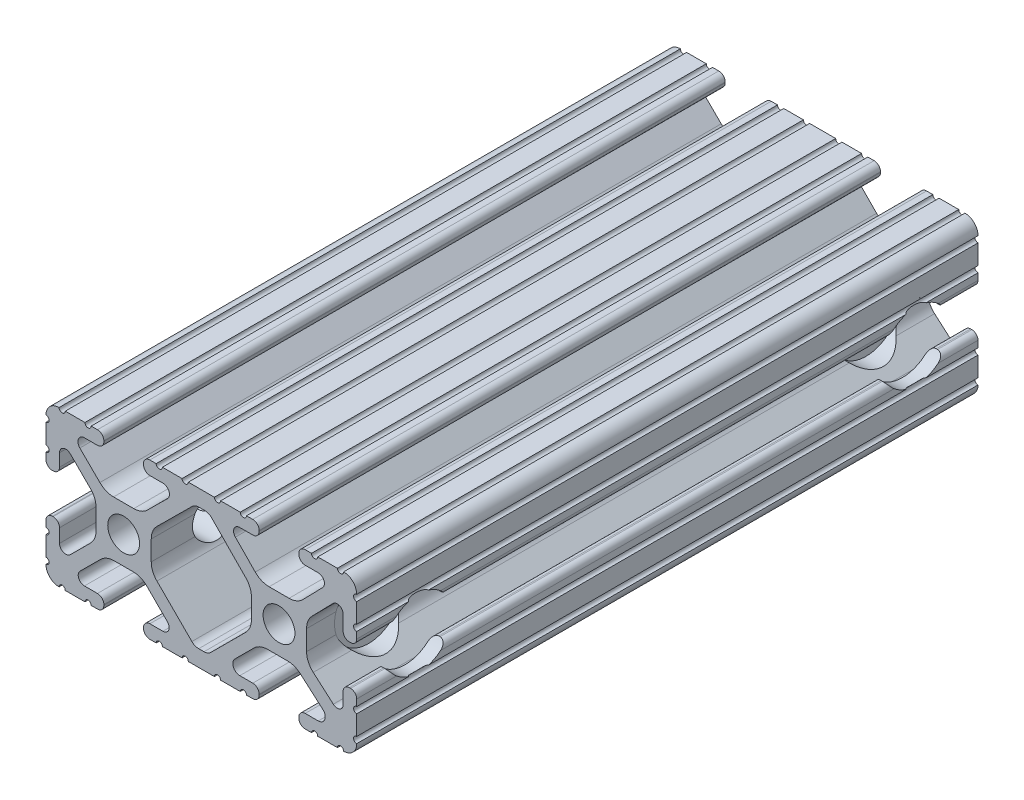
from build123d import *

# Parameters (mm, degrees)
SKETCH1_R                                        = 2.6035
BOSS_EXTRUDE1_DEPTH                              = 50.8
CBORE_FOR_1_4_SOCKET_HEAD_CAP_SCREW2_D           = 6.7564
CBORE_FOR_1_4_SOCKET_HEAD_CAP_SCREW2_CBORE_D     = 11.1125
CBORE_FOR_1_4_SOCKET_HEAD_CAP_SCREW2_CBORE_DEPTH = 8.191799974


with BuildPart() as part:
    # Sketch1 → Boss-Extrude1 (new, symmetric)
    with BuildSketch(Plane.XY):
        with BuildLine():
            Line((18.01710265, 12.7), (16.98745015, 12.7))
            ThreePointArc((16.98745015, 12.7), (16.245730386, 12.392769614), (15.9385, 11.65104985))
            Line((15.9385, 11.65104985), (15.9385, 11.53922))
            ThreePointArc((15.9385, 11.53922), (16.245750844, 10.797450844), (16.98752, 10.4902))
            Line((16.98752, 10.4902), (19.116384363, 10.4902))
            ThreePointArc((19.116384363, 10.4902), (20.052502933, 9.869096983), (19.844087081, 8.765172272))
            Line((19.844087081, 8.765172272), (16.618993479, 5.455112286))
            ThreePointArc((16.618993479, 5.455112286), (15.578994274, 4.745442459), (14.344932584, 4.4958))
            Line((14.344932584, 4.4958), (11.083317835, 4.4958))
            ThreePointArc((11.083317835, 4.4958), (9.854330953, 4.743306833), (8.816955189, 5.447238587))
            Line((8.816955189, 5.447238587), (5.564154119, 8.762652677))
            ThreePointArc((5.564154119, 8.762652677), (5.352591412, 9.867473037), (6.289393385, 10.4902))
            Line((6.289393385, 10.4902), (8.41248, 10.4902))
            ThreePointArc((8.41248, 10.4902), (9.154249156, 10.797450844), (9.4615, 11.53922))
            Line((9.4615, 11.53922), (9.4615, 11.65104985))
            ThreePointArc((9.4615, 11.65104985), (9.154269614, 12.392769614), (8.41254985, 12.7))
            Line((8.41254985, 12.7), (7.38288465, 12.7))
            ThreePointArc((7.38288465, 12.7), (6.87488465, 12.192), (6.36688465, 12.7))
            Line((6.36688465, 12.7), (3.14958095, 12.7))
            ThreePointArc((3.14958095, 12.7), (2.64158095, 12.192), (2.13358095, 12.7))
            Line((2.13358095, 12.7), (-2.13358095, 12.7))
            ThreePointArc((-2.13358095, 12.7), (-2.64158095, 12.192), (-3.14958095, 12.7))
            Line((-3.14958095, 12.7), (-6.36689735, 12.7))
            ThreePointArc((-6.36689735, 12.7), (-6.87489735, 12.192), (-7.38289735, 12.7))
            Line((-7.38289735, 12.7), (-8.41254985, 12.7))
            ThreePointArc((-8.41254985, 12.7), (-9.154269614, 12.392769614), (-9.4615, 11.65104985))
            Line((-9.4615, 11.65104985), (-9.4615, 11.53922))
            ThreePointArc((-9.4615, 11.53922), (-9.154249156, 10.797450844), (-8.41248, 10.4902))
            Line((-8.41248, 10.4902), (-6.283641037, 10.4902))
            ThreePointArc((-6.283641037, 10.4902), (-5.297291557, 9.829633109), (-5.532576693, 8.666071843))
            Line((-5.532576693, 8.666071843), (-8.809985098, 5.416263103))
            ThreePointArc((-8.809985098, 5.416263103), (-9.836720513, 4.734920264), (-11.045536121, 4.4958))
            Line((-11.045536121, 4.4958), (-14.354463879, 4.4958))
            ThreePointArc((-14.354463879, 4.4958), (-15.563279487, 4.734920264), (-16.590014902, 5.416263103))
            Line((-16.590014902, 5.416263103), (-19.867423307, 8.666071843))
            ThreePointArc((-19.867423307, 8.666071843), (-20.102708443, 9.829633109), (-19.116358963, 10.4902))
            Line((-19.116358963, 10.4902), (-16.98752, 10.4902))
            ThreePointArc((-16.98752, 10.4902), (-16.245750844, 10.797450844), (-15.9385, 11.53922))
            Line((-15.9385, 11.53922), (-15.9385, 11.65104985))
            ThreePointArc((-15.9385, 11.65104985), (-16.245730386, 12.392769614), (-16.98745015, 12.7))
            Line((-16.98745015, 12.7), (-18.01711535, 12.7))
            ThreePointArc((-18.01711535, 12.7), (-18.52511535, 12.192), (-19.03311535, 12.7))
            Line((-19.03311535, 12.7), (-22.2504, 12.7))
            ThreePointArc((-22.2504, 12.7), (-22.758323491, 12.192000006), (-23.266399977, 12.699846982))
            ThreePointArc((-23.266399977, 12.699846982), (-24.782522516, 12.082522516), (-25.399846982, 10.566399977))
            ThreePointArc((-25.399846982, 10.566399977), (-24.892000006, 10.058323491), (-25.4, 9.5504))
            Line((-25.4, 9.5504), (-25.4, 6.3330836))
            ThreePointArc((-25.4, 6.3330836), (-24.892, 5.8250836), (-25.4, 5.3170836))
            Line((-25.4, 5.3170836), (-25.4, 4.237520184))
            ThreePointArc((-25.4, 4.237520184), (-25.107393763, 3.531106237), (-24.400979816, 3.2385))
            Line((-24.400979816, 3.2385), (-24.23922, 3.2385))
            ThreePointArc((-24.23922, 3.2385), (-23.497450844, 3.545750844), (-23.1902, 4.28752))
            Line((-23.1902, 4.28752), (-23.1902, 6.334741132))
            ThreePointArc((-23.1902, 6.334741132), (-22.556026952, 7.286023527), (-21.434002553, 7.066535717))
            Line((-21.434002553, 7.066535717), (-18.147950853, 3.808156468))
            ThreePointArc((-18.147950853, 3.808156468), (-17.452759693, 2.774838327), (-17.208501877, 1.553619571))
            Line((-17.208501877, 1.553619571), (-17.208501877, -1.695179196))
            ThreePointArc((-17.208501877, -1.695179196), (-17.450738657, -2.911536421), (-18.140486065, -3.942289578))
            Line((-18.140486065, -3.942289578), (-21.431579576, -7.227386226))
            ThreePointArc((-21.431579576, -7.227386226), (-22.55444896, -7.449940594), (-23.1902, -6.498002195))
            Line((-23.1902, -6.498002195), (-23.1902, -4.28752))
            ThreePointArc((-23.1902, -4.28752), (-23.497450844, -3.545750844), (-24.23922, -3.2385))
            Line((-24.23922, -3.2385), (-24.35098, -3.2385))
            ThreePointArc((-24.35098, -3.2385), (-25.092749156, -3.545750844), (-25.4, -4.28752))
            Line((-25.4, -4.28752), (-25.4, -5.3171344))
            ThreePointArc((-25.4, -5.3171344), (-24.892, -5.8251344), (-25.4, -6.3331344))
            Line((-25.4, -6.3331344), (-25.4, -9.5504))
            ThreePointArc((-25.4, -9.5504), (-24.892000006, -10.058323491), (-25.399846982, -10.566399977))
            ThreePointArc((-25.399846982, -10.566399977), (-24.782522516, -12.082522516), (-23.266399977, -12.699846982))
            ThreePointArc((-23.266399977, -12.699846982), (-22.758323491, -12.192000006), (-22.2504, -12.7))
            Line((-22.2504, -12.7), (-19.03308995, -12.7))
            ThreePointArc((-19.03308995, -12.7), (-18.52508995, -12.192), (-18.01708995, -12.7))
            Line((-18.01708995, -12.7), (-16.9874692, -12.7))
            ThreePointArc((-16.9874692, -12.7), (-16.245700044, -12.392749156), (-15.9384492, -11.65098))
            Line((-15.9384492, -11.65098), (-15.9384492, -11.53922))
            ThreePointArc((-15.9384492, -11.53922), (-16.245700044, -10.797450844), (-16.9874692, -10.4902))
            Line((-16.9874692, -10.4902), (-19.116358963, -10.4902))
            ThreePointArc((-19.116358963, -10.4902), (-20.055197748, -9.862578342), (-19.834124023, -8.755124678))
            Line((-19.834124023, -8.755124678), (-16.49660751, -5.423689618))
            ThreePointArc((-16.49660751, -5.423689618), (-15.467274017, -4.736928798), (-14.253591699, -4.4958))
            Line((-14.253591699, -4.4958), (-11.146408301, -4.4958))
            ThreePointArc((-11.146408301, -4.4958), (-9.932725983, -4.736928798), (-8.90339249, -5.423689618))
            Line((-8.90339249, -5.423689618), (-5.565875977, -8.755124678))
            ThreePointArc((-5.565875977, -8.755124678), (-5.344802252, -9.862578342), (-6.283641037, -10.4902))
            Line((-6.283641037, -10.4902), (-8.4125308, -10.4902))
            ThreePointArc((-8.4125308, -10.4902), (-9.154299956, -10.797450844), (-9.4615508, -11.53922))
            Line((-9.4615508, -11.53922), (-9.4615508, -11.65098))
            ThreePointArc((-9.4615508, -11.65098), (-9.154299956, -12.392749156), (-8.4125308, -12.7))
            Line((-8.4125308, -12.7), (-7.38287195, -12.7))
            ThreePointArc((-7.38287195, -12.7), (-6.87487195, -12.192), (-6.36687195, -12.7))
            Line((-6.36687195, -12.7), (-3.14960635, -12.7))
            ThreePointArc((-3.14960635, -12.7), (-2.64160635, -12.192), (-2.13360635, -12.7))
            Line((-2.13360635, -12.7), (2.13360635, -12.7))
            ThreePointArc((2.13360635, -12.7), (2.64159365, -12.1920127), (3.14958095, -12.7))
            Line((3.14958095, -12.7), (6.36691005, -12.7))
            ThreePointArc((6.36691005, -12.7), (6.87491005, -12.192), (7.38291005, -12.7))
            Line((7.38291005, -12.7), (8.4125308, -12.7))
            ThreePointArc((8.4125308, -12.7), (9.154299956, -12.392749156), (9.4615508, -11.65098))
            Line((9.4615508, -11.65098), (9.4615508, -11.53922))
            ThreePointArc((9.4615508, -11.53922), (9.154299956, -10.797450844), (8.4125308, -10.4902))
            Line((8.4125308, -10.4902), (6.289393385, -10.4902))
            ThreePointArc((6.289393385, -10.4902), (5.231590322, -9.783049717), (5.480677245, -8.535265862))
            Line((5.480677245, -8.535265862), (8.597933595, -5.423689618))
            ThreePointArc((8.597933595, -5.423689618), (9.627267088, -4.736928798), (10.840949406, -4.4958))
            Line((10.840949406, -4.4958), (14.102564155, -4.4958))
            ThreePointArc((14.102564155, -4.4958), (15.215927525, -4.697410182), (16.187895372, -5.276636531))
            Line((16.187895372, -5.276636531), (19.868247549, -8.482246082))
            ThreePointArc((19.868247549, -8.482246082), (20.188435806, -9.746879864), (19.116384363, -10.4902))
            Line((19.116384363, -10.4902), (16.9874692, -10.4902))
            ThreePointArc((16.9874692, -10.4902), (16.245700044, -10.797450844), (15.9384492, -11.53922))
            Line((15.9384492, -11.53922), (15.9384492, -11.65098))
            ThreePointArc((15.9384492, -11.65098), (16.245700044, -12.392749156), (16.9874692, -12.7))
            Line((16.9874692, -12.7), (18.01710265, -12.7))
            ThreePointArc((18.01710265, -12.7), (18.52510265, -12.192), (19.03310265, -12.7))
            Line((19.03310265, -12.7), (22.2504, -12.7))
            ThreePointArc((22.2504, -12.7), (22.758323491, -12.192000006), (23.266399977, -12.699846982))
            ThreePointArc((23.266399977, -12.699846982), (24.782522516, -12.082522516), (25.399846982, -10.566399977))
            ThreePointArc((25.399846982, -10.566399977), (24.892000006, -10.058323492), (25.4, -9.550400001))
            Line((25.4, -9.550400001), (25.4, -6.333083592))
            ThreePointArc((25.4, -6.333083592), (24.892000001, -5.825083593), (25.4, -5.317083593))
            Line((25.4, -5.317083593), (25.4, -4.237520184))
            ThreePointArc((25.4, -4.237520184), (25.107393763, -3.531106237), (24.400979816, -3.2385))
            Line((24.400979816, -3.2385), (24.189220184, -3.2385))
            ThreePointArc((24.189220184, -3.2385), (23.482806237, -3.531106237), (23.1902, -4.237520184))
            Line((23.1902, -4.237520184), (23.1902, -6.155876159))
            ThreePointArc((23.1902, -6.155876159), (22.62232736, -7.038258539), (21.583974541, -6.886926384))
            Line((21.583974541, -6.886926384), (18.29817066, -4.024970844))
            ThreePointArc((18.29817066, -4.024970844), (17.493730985, -2.946044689), (17.208501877, -1.630807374))
            Line((17.208501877, -1.630807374), (17.208501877, 1.630807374))
            ThreePointArc((17.208501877, 1.630807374), (17.442348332, 2.82673414), (18.109440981, 3.846495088))
            Line((18.109440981, 3.846495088), (21.526346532, 7.353420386))
            ThreePointArc((21.526346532, 7.353420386), (22.585896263, 7.574939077), (23.1902, 6.676867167))
            Line((23.1902, 6.676867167), (23.1902, 4.237520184))
            ThreePointArc((23.1902, 4.237520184), (23.482806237, 3.531106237), (24.189220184, 3.2385))
            Line((24.189220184, 3.2385), (24.400979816, 3.2385))
            ThreePointArc((24.400979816, 3.2385), (25.107393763, 3.531106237), (25.4, 4.237520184))
            Line((25.4, 4.237520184), (25.4, 5.3170836))
            ThreePointArc((25.4, 5.3170836), (24.891949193, 5.825134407), (25.4, 6.333185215))
            Line((25.4, 6.333185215), (25.4, 9.550400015))
            ThreePointArc((25.4, 9.550400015), (24.892000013, 10.058323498), (25.399846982, 10.566399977))
            ThreePointArc((25.399846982, 10.566399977), (24.782522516, 12.082522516), (23.266399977, 12.699846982))
            ThreePointArc((23.266399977, 12.699846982), (22.758323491, 12.192000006), (22.2504, 12.7))
            Line((22.2504, 12.7), (19.03310265, 12.7))
            ThreePointArc((19.03310265, 12.7), (18.52510265, 12.192), (18.01710265, 12.7))
        make_face()
        with Locations((-12.7, 0)):
            Circle(SKETCH1_R, mode=Mode.SUBTRACT)
        with Locations((12.7, 0)):
            Circle(SKETCH1_R, mode=Mode.SUBTRACT)
        with BuildLine():
            Line((-7.259513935, -3.869413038), (-1.545748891, -9.572766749))
            ThreePointArc((-1.545748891, -9.572766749), (-1.035199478, -9.913400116), (-0.433213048, -10.033))
            Line((-0.433213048, -10.033), (0.433213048, -10.033))
            ThreePointArc((0.433213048, -10.033), (1.035199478, -9.913400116), (1.545748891, -9.572766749))
            Line((1.545748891, -9.572766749), (7.259513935, -3.869413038))
            ThreePointArc((7.259513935, -3.869413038), (7.949261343, -2.838659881), (8.191498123, -1.622302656))
            Line((8.191498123, -1.622302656), (8.191498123, 1.622302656))
            ThreePointArc((8.191498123, 1.622302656), (7.955573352, 2.823327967), (7.282860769, 3.845864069))
            Line((7.282860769, 3.845864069), (1.675572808, 9.561086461))
            ThreePointArc((1.675572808, 9.561086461), (1.161034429, 9.910236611), (0.551456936, 10.033))
            Line((0.551456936, 10.033), (-0.395199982, 10.033))
            ThreePointArc((-0.395199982, 10.033), (-0.994772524, 9.914396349), (-1.50403329, 9.576450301))
            Line((-1.50403329, 9.576450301), (-7.252049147, 3.876839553))
            ThreePointArc((-7.252049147, 3.876839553), (-7.947240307, 2.843521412), (-8.191498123, 1.622302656))
            Line((-8.191498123, 1.622302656), (-8.191498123, -1.622302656))
            ThreePointArc((-8.191498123, -1.622302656), (-7.949261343, -2.838659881), (-7.259513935, -3.869413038))
        make_face(mode=Mode.SUBTRACT)
    extrude(amount=BOSS_EXTRUDE1_DEPTH, both=True)

    # CBORE for 1_4 Socket Head Cap Screw2 (through all)
    with Locations(Plane(origin=(25.4, 0, 0), x_dir=(0, 0, -1), z_dir=(1, 0, 0))):
        with Locations((40.6781, 0), (-40.6781, 0)):
            CounterBoreHole(CBORE_FOR_1_4_SOCKET_HEAD_CAP_SCREW2_D / 2, CBORE_FOR_1_4_SOCKET_HEAD_CAP_SCREW2_CBORE_D / 2, CBORE_FOR_1_4_SOCKET_HEAD_CAP_SCREW2_CBORE_DEPTH)


solid = part.part
